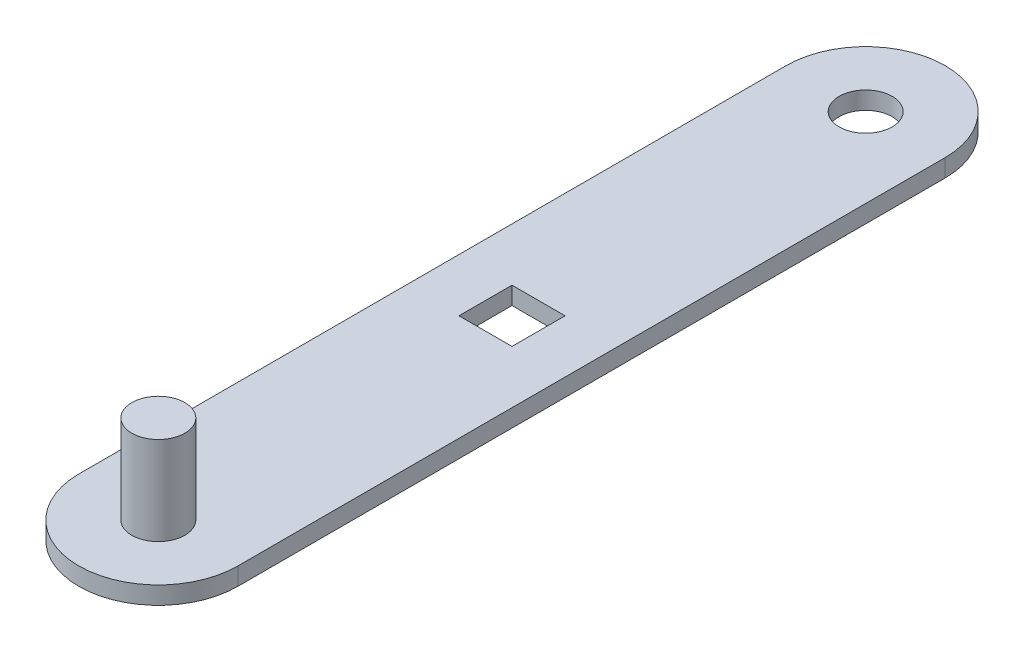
from build123d import *

# Parameters (mm, degrees)
SKETCH1_W           = 450
SKETCH1_H           = 2000
BOSS_EXTRUDE1_DEPTH = 50
BOSS_EXTRUDE2_DEPTH = 250
CUT_EXTRUDE2_DEPTH  = 250
SKETCH4_W           = 150
SKETCH4_H           = 150
CUT_EXTRUDE3_DEPTH  = 1271.334601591


with BuildPart() as part:
    # Sketch1 → Boss-Extrude1 (new body)
    with BuildSketch(Plane(origin=(0, 0, 0), x_dir=(1, 0, 0), z_dir=(0, 1, 0))):
        Rectangle(SKETCH1_W, SKETCH1_H)
        with BuildLine():
            Line((-225, 1000), (225, 1000))
            ThreePointArc((225, 1000), (0, 1225), (-225, 1000))
        make_face()
        with BuildLine():
            ThreePointArc((225, -1000), (0, -1225), (-225, -1000))
            Line((-225, -1000), (225, -1000))
        make_face()
    extrude(amount=BOSS_EXTRUDE1_DEPTH)

    # Sketch2 → Boss-Extrude2 (add)
    with BuildSketch(Plane(origin=(0, 50, 0), x_dir=(1, 0, 0), z_dir=(0, 1, 0))):
        with BuildLine():
            ThreePointArc((75, -1000), (0, -925), (-75, -1000))
            Line((-75, -1000), (75, -1000))
        make_face()
        with BuildLine():
            Line((75, -1000), (-75, -1000))
            ThreePointArc((-75, -1000), (0, -1075), (75, -1000))
        make_face()
        with BuildLine():
            ThreePointArc((75, -1000), (0, -925), (-75, -1000))
            Line((-75, -1000), (75, -1000))
        make_face()
        with BuildLine():
            Line((75, -1000), (-75, -1000))
            ThreePointArc((-75, -1000), (0, -1075), (75, -1000))
        make_face()
    extrude(amount=BOSS_EXTRUDE2_DEPTH)

    # Sketch3 → Cut-Extrude2 (cut)
    with BuildSketch(Plane(origin=(0, 50, 0), x_dir=(1, 0, 0), z_dir=(0, 1, 0))):
        with BuildLine():
            ThreePointArc((75, 1000), (0, 1075), (-75, 1000))
            Line((-75, 1000), (75, 1000))
        make_face()
        with BuildLine():
            Line((75, 1000), (-75, 1000))
            ThreePointArc((-75, 1000), (0, 925), (75, 1000))
        make_face()
        with BuildLine():
            ThreePointArc((75, 1000), (0, 1075), (-75, 1000))
            Line((-75, 1000), (75, 1000))
        make_face()
        with BuildLine():
            Line((75, 1000), (-75, 1000))
            ThreePointArc((-75, 1000), (0, 925), (75, 1000))
        make_face()
    extrude(amount=-CUT_EXTRUDE2_DEPTH, mode=Mode.SUBTRACT)

    # Sketch4 → Cut-Extrude3 (cut, through all)
    with BuildSketch(Plane(origin=(0, 50, 0), x_dir=(1, 0, 0), z_dir=(0, 1, 0))):
        Rectangle(SKETCH4_W, SKETCH4_H)
    extrude(amount=-CUT_EXTRUDE3_DEPTH, mode=Mode.SUBTRACT)


solid = part.part
